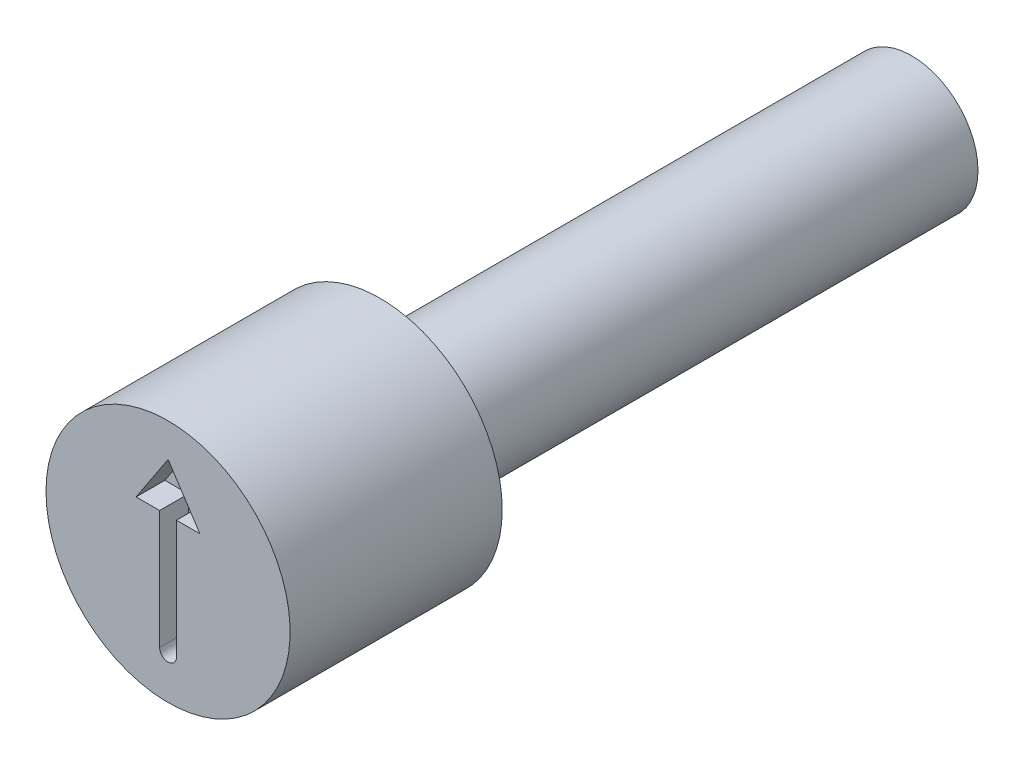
ISO-10303-21;
HEADER;
FILE_DESCRIPTION(('STEP AP214'),'2;1');
FILE_NAME('part.step','',(''),(''),'','','');
FILE_SCHEMA(('AUTOMOTIVE_DESIGN { 1 0 10303 214 1 1 1 1 }'));
ENDSEC;
DATA;
#1=APPLICATION_CONTEXT('core data for automotive mechanical design processes');
#2=APPLICATION_PROTOCOL_DEFINITION('international standard','automotive_design',2000,#1);
#3=PRODUCT_CONTEXT('',#1,'mechanical');
#4=PRODUCT('Part','Part','',(#3));
#5=PRODUCT_RELATED_PRODUCT_CATEGORY('part','',(#4));
#6=PRODUCT_DEFINITION_FORMATION('','',#4);
#7=PRODUCT_DEFINITION_CONTEXT('part definition',#1,'design');
#8=PRODUCT_DEFINITION('design','',#6,#7);
#9=PRODUCT_DEFINITION_SHAPE('','',#8);
#10=(LENGTH_UNIT() NAMED_UNIT(*) SI_UNIT(.MILLI.,.METRE.));
#11=(NAMED_UNIT(*) PLANE_ANGLE_UNIT() SI_UNIT($,.RADIAN.));
#12=(NAMED_UNIT(*) SI_UNIT($,.STERADIAN.) SOLID_ANGLE_UNIT());
#13=UNCERTAINTY_MEASURE_WITH_UNIT(LENGTH_MEASURE(1.E-05),#10,'distance_accuracy_value','');
#14=(GEOMETRIC_REPRESENTATION_CONTEXT(3) GLOBAL_UNCERTAINTY_ASSIGNED_CONTEXT((#13)) GLOBAL_UNIT_ASSIGNED_CONTEXT((#10,
#11,#12)) REPRESENTATION_CONTEXT('',''));
#15=CARTESIAN_POINT('',(0.,0.,0.));
#16=DIRECTION('',(0.,0.,1.));
#17=DIRECTION('',(1.,0.,0.));
#18=AXIS2_PLACEMENT_3D('',#15,#16,#17);
#19=CARTESIAN_POINT('',(1.466383E-13,0.113834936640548,-0.541866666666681));
#20=DIRECTION('',(0.,0.,1.));
#21=DIRECTION('',(1.,0.,0.));
#22=AXIS2_PLACEMENT_3D('',#19,#20,#21);
#23=PLANE('',#22);
#24=DIRECTION('',(1.,0.,0.));
#25=VECTOR('',#24,1.);
#26=CARTESIAN_POINT('',(0.60159926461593,0.755294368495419,-0.541866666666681));
#27=LINE('',#26,#25);
#28=CARTESIAN_POINT('',(0.158727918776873,0.755294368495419,-0.541866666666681));
#29=VERTEX_POINT('',#28);
#30=CARTESIAN_POINT('',(0.601599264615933,0.755294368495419,-0.541866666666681));
#31=VERTEX_POINT('',#30);
#32=EDGE_CURVE('E125',#29,#31,#27,.T.);
#33=ORIENTED_EDGE('',*,*,#32,.T.);
#34=DIRECTION('',(-0.550159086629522,0.835059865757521,0.));
#35=VECTOR('',#34,1.);
#36=CARTESIAN_POINT('',(0.,1.66843279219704,-0.541866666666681));
#37=LINE('',#36,#35);
#38=CARTESIAN_POINT('',(0.,1.66843279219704,-0.541866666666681));
#39=VERTEX_POINT('',#38);
#40=EDGE_CURVE('E135',#31,#39,#37,.T.);
#41=ORIENTED_EDGE('',*,*,#40,.T.);
#42=DIRECTION('',(-0.550159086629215,-0.835059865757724,0.));
#43=VECTOR('',#42,1.);
#44=CARTESIAN_POINT('',(-0.601599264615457,0.755294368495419,-0.541866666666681));
#45=LINE('',#44,#43);
#46=CARTESIAN_POINT('',(-0.601599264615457,0.755294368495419,-0.541866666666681));
#47=VERTEX_POINT('',#46);
#48=EDGE_CURVE('E140',#39,#47,#45,.T.);
#49=ORIENTED_EDGE('',*,*,#48,.T.);
#50=DIRECTION('',(1.,0.,0.));
#51=VECTOR('',#50,1.);
#52=CARTESIAN_POINT('',(-0.158727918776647,0.755294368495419,-0.541866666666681));
#53=LINE('',#52,#51);
#54=CARTESIAN_POINT('',(-0.158727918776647,0.755294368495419,-0.541866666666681));
#55=VERTEX_POINT('',#54);
#56=EDGE_CURVE('E101',#47,#55,#53,.T.);
#57=ORIENTED_EDGE('',*,*,#56,.T.);
#58=DIRECTION('',(0.,1.,0.));
#59=VECTOR('',#58,1.);
#60=CARTESIAN_POINT('',(-0.158727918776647,-1.48013782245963,-0.541866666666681));
#61=LINE('',#60,#59);
#62=CARTESIAN_POINT('',(-0.158727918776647,-1.48013782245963,-0.541866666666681));
#63=VERTEX_POINT('',#62);
#64=EDGE_CURVE('E96',#55,#63,#61,.F.);
#65=ORIENTED_EDGE('',*,*,#64,.T.);
#66=CARTESIAN_POINT('',(1.128084E-13,-1.48013782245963,-0.541866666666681));
#67=DIRECTION('',(0.,0.,1.));
#68=DIRECTION('',(1.,0.,0.));
#69=AXIS2_PLACEMENT_3D('',#66,#67,#68);
#70=CIRCLE('',#69,0.158727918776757);
#71=CARTESIAN_POINT('',(0.158727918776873,-1.48013782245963,-0.541866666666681));
#72=VERTEX_POINT('',#71);
#73=EDGE_CURVE('E98',#63,#72,#70,.T.);
#74=ORIENTED_EDGE('',*,*,#73,.T.);
#75=DIRECTION('',(0.,1.,0.));
#76=VECTOR('',#75,1.);
#77=CARTESIAN_POINT('',(0.158727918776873,0.755294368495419,-0.541866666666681));
#78=LINE('',#77,#76);
#79=EDGE_CURVE('E131',#72,#29,#78,.T.);
#80=ORIENTED_EDGE('',*,*,#79,.T.);
#81=EDGE_LOOP('',(#33,#41,#49,#57,#65,#74,#80));
#82=FACE_BOUND('',#81,.T.);
#83=ADVANCED_FACE('F41',(#82),#23,.T.);
#84=CARTESIAN_POINT('',(1.128084E-13,-1.48013782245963,-0.541866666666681));
#85=DIRECTION('',(0.,0.,1.));
#86=DIRECTION('',(1.,0.,0.));
#87=AXIS2_PLACEMENT_3D('',#84,#85,#86);
#88=CYLINDRICAL_SURFACE('',#87,0.158727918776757);
#89=ORIENTED_EDGE('',*,*,#73,.F.);
#90=DIRECTION('',(0.,0.,1.));
#91=VECTOR('',#90,1.);
#92=CARTESIAN_POINT('',(-0.158727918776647,-1.48013782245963,-0.541866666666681));
#93=LINE('',#92,#91);
#94=CARTESIAN_POINT('',(-0.158727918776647,-1.48013782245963,0.));
#95=VERTEX_POINT('',#94);
#96=EDGE_CURVE('E105',#63,#95,#93,.T.);
#97=ORIENTED_EDGE('',*,*,#96,.T.);
#98=CARTESIAN_POINT('',(1.128084E-13,-1.48013782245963,0.));
#99=DIRECTION('',(0.,0.,1.));
#100=DIRECTION('',(1.,0.,0.));
#101=AXIS2_PLACEMENT_3D('',#98,#99,#100);
#102=CIRCLE('',#101,0.158727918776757);
#103=CARTESIAN_POINT('',(0.158727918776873,-1.48013782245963,0.));
#104=VERTEX_POINT('',#103);
#105=EDGE_CURVE('E154',#104,#95,#102,.F.);
#106=ORIENTED_EDGE('',*,*,#105,.F.);
#107=DIRECTION('',(0.,0.,-1.));
#108=VECTOR('',#107,1.);
#109=CARTESIAN_POINT('',(0.158727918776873,-1.48013782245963,-0.541866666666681));
#110=LINE('',#109,#108);
#111=EDGE_CURVE('E111',#104,#72,#110,.T.);
#112=ORIENTED_EDGE('',*,*,#111,.T.);
#113=EDGE_LOOP('',(#89,#97,#106,#112));
#114=FACE_BOUND('',#113,.T.);
#115=ADVANCED_FACE('F108',(#114),#88,.F.);
#116=CARTESIAN_POINT('',(-0.158727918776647,-1.48013782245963,-0.541866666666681));
#117=DIRECTION('',(-1.,0.,0.));
#118=DIRECTION('',(0.,0.,1.));
#119=AXIS2_PLACEMENT_3D('',#116,#117,#118);
#120=PLANE('',#119);
#121=ORIENTED_EDGE('',*,*,#64,.F.);
#122=DIRECTION('',(0.,0.,-1.));
#123=VECTOR('',#122,1.);
#124=CARTESIAN_POINT('',(-0.158727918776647,0.755294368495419,-0.541866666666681));
#125=LINE('',#124,#123);
#126=CARTESIAN_POINT('',(-0.158727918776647,0.755294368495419,0.));
#127=VERTEX_POINT('',#126);
#128=EDGE_CURVE('E119',#55,#127,#125,.F.);
#129=ORIENTED_EDGE('',*,*,#128,.T.);
#130=DIRECTION('',(0.,1.,0.));
#131=VECTOR('',#130,1.);
#132=CARTESIAN_POINT('',(-0.158727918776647,0.,0.));
#133=LINE('',#132,#131);
#134=EDGE_CURVE('E116',#95,#127,#133,.T.);
#135=ORIENTED_EDGE('',*,*,#134,.F.);
#136=ORIENTED_EDGE('',*,*,#96,.F.);
#137=EDGE_LOOP('',(#121,#129,#135,#136));
#138=FACE_BOUND('',#137,.T.);
#139=ADVANCED_FACE('F114',(#138),#120,.F.);
#140=CARTESIAN_POINT('',(-0.158727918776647,0.755294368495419,-0.541866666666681));
#141=DIRECTION('',(0.,-1.,0.));
#142=DIRECTION('',(0.,0.,-1.));
#143=AXIS2_PLACEMENT_3D('',#140,#141,#142);
#144=PLANE('',#143);
#145=ORIENTED_EDGE('',*,*,#56,.F.);
#146=DIRECTION('',(0.,0.,1.));
#147=VECTOR('',#146,1.);
#148=CARTESIAN_POINT('',(-0.601599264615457,0.755294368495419,-0.541866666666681));
#149=LINE('',#148,#147);
#150=CARTESIAN_POINT('',(-0.601599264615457,0.755294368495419,0.));
#151=VERTEX_POINT('',#150);
#152=EDGE_CURVE('E137',#47,#151,#149,.T.);
#153=ORIENTED_EDGE('',*,*,#152,.T.);
#154=DIRECTION('',(1.,0.,0.));
#155=VECTOR('',#154,1.);
#156=CARTESIAN_POINT('',(1.10000000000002,0.755294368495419,0.));
#157=LINE('',#156,#155);
#158=EDGE_CURVE('E157',#127,#151,#157,.F.);
#159=ORIENTED_EDGE('',*,*,#158,.F.);
#160=ORIENTED_EDGE('',*,*,#128,.F.);
#161=EDGE_LOOP('',(#145,#153,#159,#160));
#162=FACE_BOUND('',#161,.T.);
#163=ADVANCED_FACE('F194',(#162),#144,.F.);
#164=CARTESIAN_POINT('',(-0.601599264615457,0.755294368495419,-0.541866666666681));
#165=DIRECTION('',(-0.835059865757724,0.550159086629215,0.));
#166=DIRECTION('',(-0.550159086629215,-0.835059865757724,0.));
#167=AXIS2_PLACEMENT_3D('',#164,#165,#166);
#168=PLANE('',#167);
#169=ORIENTED_EDGE('',*,*,#48,.F.);
#170=DIRECTION('',(0.,0.,1.));
#171=VECTOR('',#170,1.);
#172=CARTESIAN_POINT('',(0.,1.66843279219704,-0.541866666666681));
#173=LINE('',#172,#171);
#174=CARTESIAN_POINT('',(0.,1.66843279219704,0.));
#175=VERTEX_POINT('',#174);
#176=EDGE_CURVE('E128',#39,#175,#173,.T.);
#177=ORIENTED_EDGE('',*,*,#176,.T.);
#178=DIRECTION('',(0.550159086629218,0.835059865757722,0.));
#179=VECTOR('',#178,1.);
#180=CARTESIAN_POINT('',(-0.601599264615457,0.755294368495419,0.));
#181=LINE('',#180,#179);
#182=EDGE_CURVE('E176',#151,#175,#181,.T.);
#183=ORIENTED_EDGE('',*,*,#182,.F.);
#184=ORIENTED_EDGE('',*,*,#152,.F.);
#185=EDGE_LOOP('',(#169,#177,#183,#184));
#186=FACE_BOUND('',#185,.T.);
#187=ADVANCED_FACE('F227',(#186),#168,.F.);
#188=CARTESIAN_POINT('',(0.,1.66843279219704,-0.541866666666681));
#189=DIRECTION('',(0.835059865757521,0.550159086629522,0.));
#190=DIRECTION('',(-0.550159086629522,0.835059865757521,0.));
#191=AXIS2_PLACEMENT_3D('',#188,#189,#190);
#192=PLANE('',#191);
#193=ORIENTED_EDGE('',*,*,#40,.F.);
#194=DIRECTION('',(0.,0.,-1.));
#195=VECTOR('',#194,1.);
#196=CARTESIAN_POINT('',(0.601599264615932,0.755294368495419,-0.541866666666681));
#197=LINE('',#196,#195);
#198=CARTESIAN_POINT('',(0.601599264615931,0.755294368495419,0.));
#199=VERTEX_POINT('',#198);
#200=EDGE_CURVE('E127',#31,#199,#197,.F.);
#201=ORIENTED_EDGE('',*,*,#200,.T.);
#202=DIRECTION('',(0.55015908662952,-0.835059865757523,0.));
#203=VECTOR('',#202,1.);
#204=CARTESIAN_POINT('',(0.,1.66843279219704,0.));
#205=LINE('',#204,#203);
#206=EDGE_CURVE('E168',#175,#199,#205,.T.);
#207=ORIENTED_EDGE('',*,*,#206,.F.);
#208=ORIENTED_EDGE('',*,*,#176,.F.);
#209=EDGE_LOOP('',(#193,#201,#207,#208));
#210=FACE_BOUND('',#209,.T.);
#211=ADVANCED_FACE('F223',(#210),#192,.F.);
#212=CARTESIAN_POINT('',(0.60159926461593,0.755294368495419,-0.541866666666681));
#213=DIRECTION('',(0.,-1.,0.));
#214=DIRECTION('',(0.,0.,-1.));
#215=AXIS2_PLACEMENT_3D('',#212,#213,#214);
#216=PLANE('',#215);
#217=ORIENTED_EDGE('',*,*,#32,.F.);
#218=DIRECTION('',(0.,0.,-1.));
#219=VECTOR('',#218,1.);
#220=CARTESIAN_POINT('',(0.158727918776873,0.755294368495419,-0.541866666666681));
#221=LINE('',#220,#219);
#222=CARTESIAN_POINT('',(0.158727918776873,0.755294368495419,0.));
#223=VERTEX_POINT('',#222);
#224=EDGE_CURVE('E57',#29,#223,#221,.F.);
#225=ORIENTED_EDGE('',*,*,#224,.T.);
#226=DIRECTION('',(1.,0.,0.));
#227=VECTOR('',#226,1.);
#228=CARTESIAN_POINT('',(1.10000000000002,0.755294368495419,0.));
#229=LINE('',#228,#227);
#230=EDGE_CURVE('E165',#199,#223,#229,.F.);
#231=ORIENTED_EDGE('',*,*,#230,.F.);
#232=ORIENTED_EDGE('',*,*,#200,.F.);
#233=EDGE_LOOP('',(#217,#225,#231,#232));
#234=FACE_BOUND('',#233,.T.);
#235=ADVANCED_FACE('F220',(#234),#216,.F.);
#236=CARTESIAN_POINT('',(0.158727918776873,0.755294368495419,-0.541866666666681));
#237=DIRECTION('',(1.,0.,0.));
#238=DIRECTION('',(0.,0.,-1.));
#239=AXIS2_PLACEMENT_3D('',#236,#237,#238);
#240=PLANE('',#239);
#241=ORIENTED_EDGE('',*,*,#79,.F.);
#242=ORIENTED_EDGE('',*,*,#111,.F.);
#243=DIRECTION('',(0.,1.,0.));
#244=VECTOR('',#243,1.);
#245=CARTESIAN_POINT('',(0.158727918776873,0.,0.));
#246=LINE('',#245,#244);
#247=EDGE_CURVE('E153',#223,#104,#246,.F.);
#248=ORIENTED_EDGE('',*,*,#247,.F.);
#249=ORIENTED_EDGE('',*,*,#224,.F.);
#250=EDGE_LOOP('',(#241,#242,#248,#249));
#251=FACE_BOUND('',#250,.T.);
#252=ADVANCED_FACE('F201',(#251),#240,.F.);
#253=CARTESIAN_POINT('',(1.10000000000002,0.,0.));
#254=DIRECTION('',(0.,0.,1.));
#255=DIRECTION('',(1.,0.,0.));
#256=AXIS2_PLACEMENT_3D('',#253,#254,#255);
#257=PLANE('',#256);
#258=ORIENTED_EDGE('',*,*,#230,.T.);
#259=ORIENTED_EDGE('',*,*,#247,.T.);
#260=ORIENTED_EDGE('',*,*,#105,.T.);
#261=ORIENTED_EDGE('',*,*,#134,.T.);
#262=ORIENTED_EDGE('',*,*,#158,.T.);
#263=ORIENTED_EDGE('',*,*,#182,.T.);
#264=ORIENTED_EDGE('',*,*,#206,.T.);
#265=EDGE_LOOP('',(#258,#259,#260,#261,#262,#263,#264));
#266=FACE_BOUND('',#265,.T.);
#267=CARTESIAN_POINT('',(0.,0.,0.));
#268=DIRECTION('',(0.,0.,-1.));
#269=DIRECTION('',(-1.,0.,0.));
#270=AXIS2_PLACEMENT_3D('',#267,#268,#269);
#271=CIRCLE('',#270,2.3);
#272=CARTESIAN_POINT('',(-2.3,0.,0.));
#273=VERTEX_POINT('',#272);
#274=EDGE_CURVE('E150',#273,#273,#271,.T.);
#275=ORIENTED_EDGE('',*,*,#274,.F.);
#276=EDGE_LOOP('',(#275));
#277=FACE_BOUND('',#276,.T.);
#278=ADVANCED_FACE('F197',(#266,#277),#257,.T.);
#279=CARTESIAN_POINT('',(0.,0.,0.));
#280=DIRECTION('',(0.,0.,-1.));
#281=DIRECTION('',(-1.,0.,0.));
#282=AXIS2_PLACEMENT_3D('',#279,#280,#281);
#283=CYLINDRICAL_SURFACE('',#282,2.3);
#284=ORIENTED_EDGE('',*,*,#274,.T.);
#285=EDGE_LOOP('',(#284));
#286=FACE_BOUND('',#285,.T.);
#287=CARTESIAN_POINT('',(0.,0.,-3.9972));
#288=DIRECTION('',(0.,0.,1.));
#289=DIRECTION('',(1.,0.,0.));
#290=AXIS2_PLACEMENT_3D('',#287,#288,#289);
#291=CIRCLE('',#290,2.3);
#292=CARTESIAN_POINT('',(2.3,0.,-3.9972));
#293=VERTEX_POINT('',#292);
#294=EDGE_CURVE('E113',#293,#293,#291,.T.);
#295=ORIENTED_EDGE('',*,*,#294,.T.);
#296=EDGE_LOOP('',(#295));
#297=FACE_BOUND('',#296,.T.);
#298=ADVANCED_FACE('F200',(#286,#297),#283,.T.);
#299=CARTESIAN_POINT('',(2.3,0.,-3.9972));
#300=DIRECTION('',(0.,0.,-1.));
#301=DIRECTION('',(-1.,0.,0.));
#302=AXIS2_PLACEMENT_3D('',#299,#300,#301);
#303=PLANE('',#302);
#304=CARTESIAN_POINT('',(0.,0.,-3.9972));
#305=DIRECTION('',(0.,0.,-1.));
#306=DIRECTION('',(-1.,0.,0.));
#307=AXIS2_PLACEMENT_3D('',#304,#305,#306);
#308=CIRCLE('',#307,1.25000000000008);
#309=CARTESIAN_POINT('',(-1.25000000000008,0.,-3.9972));
#310=VERTEX_POINT('',#309);
#311=EDGE_CURVE('E12',#310,#310,#308,.F.);
#312=ORIENTED_EDGE('',*,*,#311,.T.);
#313=EDGE_LOOP('',(#312));
#314=FACE_BOUND('',#313,.T.);
#315=ORIENTED_EDGE('',*,*,#294,.F.);
#316=EDGE_LOOP('',(#315));
#317=FACE_BOUND('',#316,.T.);
#318=ADVANCED_FACE('F207',(#314,#317),#303,.T.);
#319=CARTESIAN_POINT('',(0.113636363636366,0.,-14.0132));
#320=DIRECTION('',(0.,0.,1.));
#321=DIRECTION('',(1.,0.,0.));
#322=AXIS2_PLACEMENT_3D('',#319,#320,#321);
#323=PLANE('',#322);
#324=CARTESIAN_POINT('',(0.,0.,-14.0132));
#325=DIRECTION('',(0.,0.,1.));
#326=DIRECTION('',(1.,0.,0.));
#327=AXIS2_PLACEMENT_3D('',#324,#325,#326);
#328=CIRCLE('',#327,1.25000000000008);
#329=CARTESIAN_POINT('',(1.25000000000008,0.,-14.0132));
#330=VERTEX_POINT('',#329);
#331=EDGE_CURVE('E49',#330,#330,#328,.T.);
#332=ORIENTED_EDGE('',*,*,#331,.F.);
#333=EDGE_LOOP('',(#332));
#334=FACE_BOUND('',#333,.T.);
#335=ADVANCED_FACE('F248',(#334),#323,.F.);
#336=CARTESIAN_POINT('',(0.,0.,-14.0132));
#337=DIRECTION('',(0.,0.,1.));
#338=DIRECTION('',(1.,0.,0.));
#339=AXIS2_PLACEMENT_3D('',#336,#337,#338);
#340=CYLINDRICAL_SURFACE('',#339,1.25000000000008);
#341=ORIENTED_EDGE('',*,*,#311,.F.);
#342=EDGE_LOOP('',(#341));
#343=FACE_BOUND('',#342,.T.);
#344=ORIENTED_EDGE('',*,*,#331,.T.);
#345=EDGE_LOOP('',(#344));
#346=FACE_BOUND('',#345,.T.);
#347=ADVANCED_FACE('F253',(#343,#346),#340,.T.);
#348=CLOSED_SHELL('',(#83,#115,#139,#163,#187,#211,#235,#252,#278,#298,#318,#335,#347));
#349=MANIFOLD_SOLID_BREP('B2',#348);
#350=ADVANCED_BREP_SHAPE_REPRESENTATION('',(#18,#349),#14);
#351=SHAPE_DEFINITION_REPRESENTATION(#9,#350);
ENDSEC;
END-ISO-10303-21;
